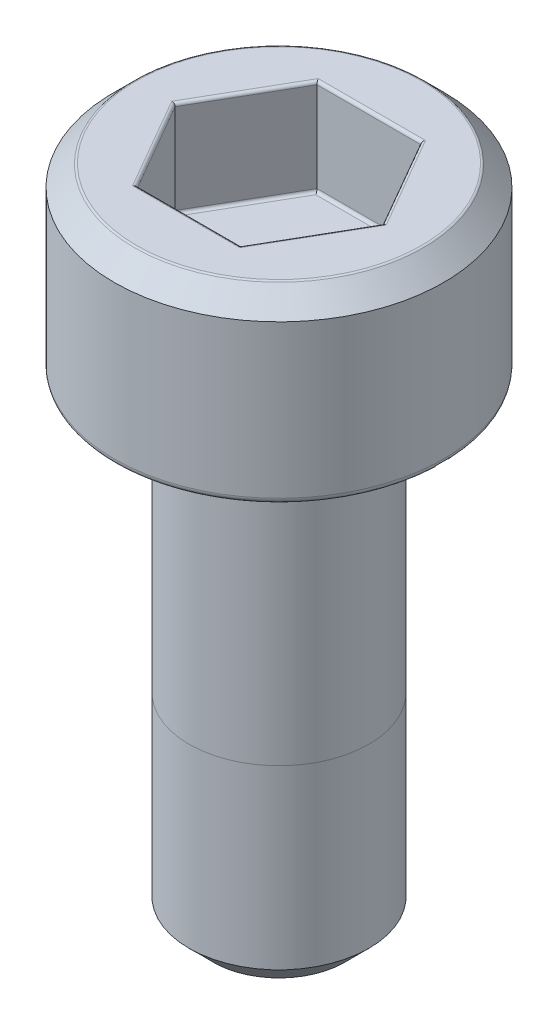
from build123d import *

# Parameters (mm, degrees)
CHAMFER1_SIZE      = 0.35
CHAMFER2_SIZE      = 0.4
FILLET1_R          = 0.1
CUT_EXTRUDE1_DEPTH = 1.6
FILLET2_R          = 0.05


with BuildPart() as part:
    # Sketch1 → Base-Revolve (revolve)
    with BuildSketch(Plane.XY, mode=Mode.PRIVATE) as base_revolve_sk:
        Polygon((0, 3), (2.75, 3), (2.75, 0), (1.5, 0), (1.5, -8), (0, -8), align=None)
    revolve(base_revolve_sk.sketch.rotate(Axis((0, 71.628, 0), (0, -1, 0)), 90), axis=Axis((0, 71.628, 0), (0, -1, 0)))

    # Chamfer1
    chamfer1_edges = [part.edges().sort_by_distance(p)[0] for p in [
        (0, 3, -2.75),
    ]]
    chamfer(chamfer1_edges, length=CHAMFER1_SIZE)

    # Chamfer2
    chamfer2_edges = [part.edges().sort_by_distance(p)[0] for p in [
        (0, -8, -1.5),
    ]]
    chamfer(chamfer2_edges, length=CHAMFER2_SIZE)

    # Fillet1
    fillet1_edges = [part.edges().sort_by_distance(p)[0] for p in [
        (0, 0, -1.5),
        (0, 0, -2.75),
    ]]
    fillet(fillet1_edges, radius=FILLET1_R)

    # Sketch2 → Cut-Extrude1 (cut)
    with BuildSketch(Plane(origin=(0, 3, 0), x_dir=(-1, 0, 0), z_dir=(0, 1, 0))):
        Polygon((-0.866025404, 1.5), (-1.732050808, 0), (-0.866025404, -1.5), (0.866025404, -1.5), (1.732050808, 0), (0.866025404, 1.5), align=None)
    extrude(amount=-CUT_EXTRUDE1_DEPTH, mode=Mode.SUBTRACT)

    # Fillet2
    fillet2_edges = [part.edges().sort_by_distance(p)[0] for p in [
        (0, 3, -2.4),
        (1.299038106, 3, 0.75),
        (1.299038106, 3, -0.75),
        (0, 3, -1.5),
        (-1.299038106, 3, -0.75),
        (-1.299038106, 3, 0.75),
        (0, 3, 1.5),
        (1.299038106, 1.4, 0.75),
        (1.299038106, 1.4, -0.75),
        (0, 1.4, -1.5),
        (-1.299038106, 1.4, -0.75),
        (-1.299038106, 1.4, 0.75),
        (0, 1.4, 1.5),
    ]]
    fillet(fillet2_edges, radius=FILLET2_R)


solid = part.part
